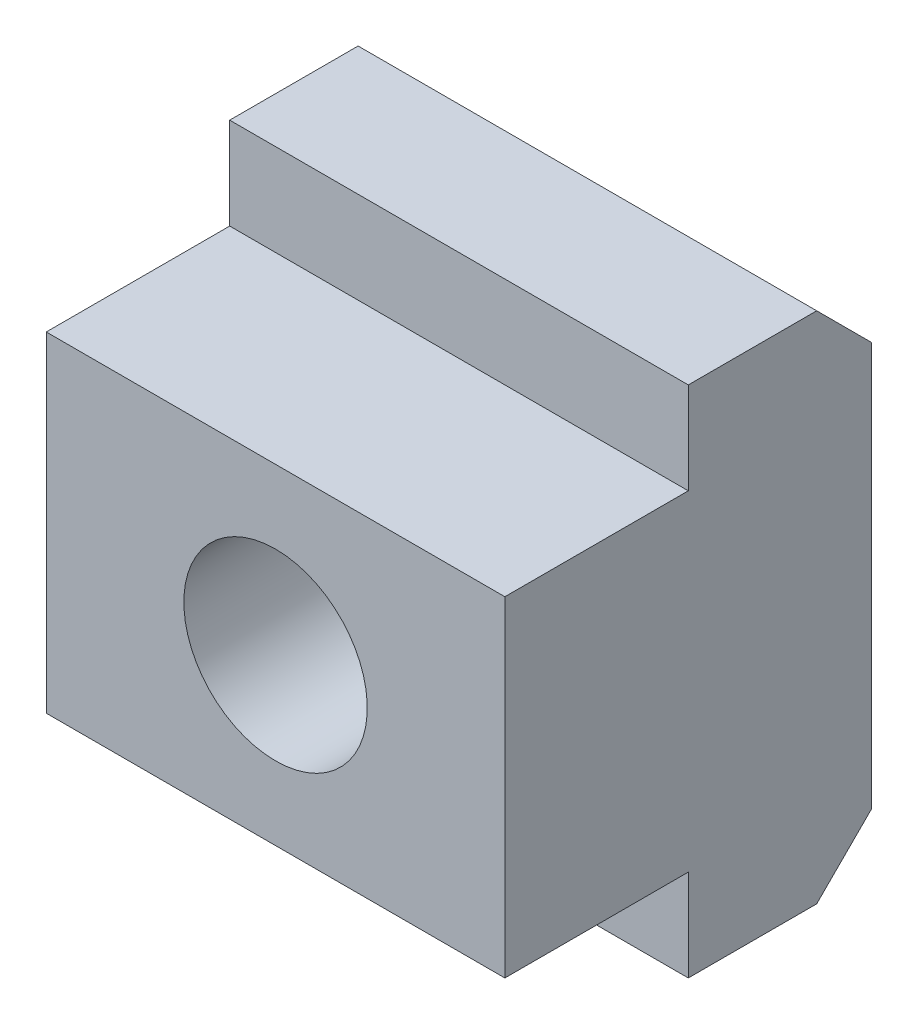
ISO-10303-21;
HEADER;
FILE_DESCRIPTION(('STEP AP214'),'2;1');
FILE_NAME('part.step','',(''),(''),'','','');
FILE_SCHEMA(('AUTOMOTIVE_DESIGN { 1 0 10303 214 1 1 1 1 }'));
ENDSEC;
DATA;
#1=APPLICATION_CONTEXT('core data for automotive mechanical design processes');
#2=APPLICATION_PROTOCOL_DEFINITION('international standard','automotive_design',2000,#1);
#3=PRODUCT_CONTEXT('',#1,'mechanical');
#4=PRODUCT('Part','Part','',(#3));
#5=PRODUCT_RELATED_PRODUCT_CATEGORY('part','',(#4));
#6=PRODUCT_DEFINITION_FORMATION('','',#4);
#7=PRODUCT_DEFINITION_CONTEXT('part definition',#1,'design');
#8=PRODUCT_DEFINITION('design','',#6,#7);
#9=PRODUCT_DEFINITION_SHAPE('','',#8);
#10=(LENGTH_UNIT() NAMED_UNIT(*) SI_UNIT(.MILLI.,.METRE.));
#11=(NAMED_UNIT(*) PLANE_ANGLE_UNIT() SI_UNIT($,.RADIAN.));
#12=(NAMED_UNIT(*) SI_UNIT($,.STERADIAN.) SOLID_ANGLE_UNIT());
#13=UNCERTAINTY_MEASURE_WITH_UNIT(LENGTH_MEASURE(1.E-05),#10,'distance_accuracy_value','');
#14=(GEOMETRIC_REPRESENTATION_CONTEXT(3) GLOBAL_UNCERTAINTY_ASSIGNED_CONTEXT((#13)) GLOBAL_UNIT_ASSIGNED_CONTEXT((#10,
#11,#12)) REPRESENTATION_CONTEXT('',''));
#15=CARTESIAN_POINT('',(0.,0.,0.));
#16=DIRECTION('',(0.,0.,1.));
#17=DIRECTION('',(1.,0.,0.));
#18=AXIS2_PLACEMENT_3D('',#15,#16,#17);
#19=CARTESIAN_POINT('',(-12.5,-9.,10.));
#20=DIRECTION('',(0.,1.,0.));
#21=DIRECTION('',(0.,0.,-1.));
#22=AXIS2_PLACEMENT_3D('',#19,#20,#21);
#23=PLANE('',#22);
#24=DIRECTION('',(0.,0.,1.));
#25=VECTOR('',#24,1.);
#26=CARTESIAN_POINT('',(12.5,-9.,10.));
#27=LINE('',#26,#25);
#28=CARTESIAN_POINT('',(12.5,-9.,0.));
#29=VERTEX_POINT('',#28);
#30=CARTESIAN_POINT('',(12.5,-9.,10.));
#31=VERTEX_POINT('',#30);
#32=EDGE_CURVE('E98',#29,#31,#27,.T.);
#33=ORIENTED_EDGE('',*,*,#32,.T.);
#34=DIRECTION('',(1.,0.,0.));
#35=VECTOR('',#34,1.);
#36=CARTESIAN_POINT('',(-12.5,-9.,10.));
#37=LINE('',#36,#35);
#38=CARTESIAN_POINT('',(-12.5,-9.,10.));
#39=VERTEX_POINT('',#38);
#40=EDGE_CURVE('E106',#39,#31,#37,.T.);
#41=ORIENTED_EDGE('',*,*,#40,.F.);
#42=DIRECTION('',(0.,0.,1.));
#43=VECTOR('',#42,1.);
#44=CARTESIAN_POINT('',(-12.5,-9.,10.));
#45=LINE('',#44,#43);
#46=CARTESIAN_POINT('',(-12.5,-9.,0.));
#47=VERTEX_POINT('',#46);
#48=EDGE_CURVE('E136',#47,#39,#45,.T.);
#49=ORIENTED_EDGE('',*,*,#48,.F.);
#50=DIRECTION('',(1.,0.,0.));
#51=VECTOR('',#50,1.);
#52=CARTESIAN_POINT('',(-12.5,-9.,0.));
#53=LINE('',#52,#51);
#54=EDGE_CURVE('E117',#47,#29,#53,.T.);
#55=ORIENTED_EDGE('',*,*,#54,.T.);
#56=EDGE_LOOP('',(#33,#41,#49,#55));
#57=FACE_BOUND('',#56,.T.);
#58=ADVANCED_FACE('F14',(#57),#23,.F.);
#59=CARTESIAN_POINT('',(-12.5,9.,10.));
#60=DIRECTION('',(0.,0.,-1.));
#61=DIRECTION('',(0.,-1.,0.));
#62=AXIS2_PLACEMENT_3D('',#59,#60,#61);
#63=PLANE('',#62);
#64=CARTESIAN_POINT('',(0.,0.,10.));
#65=DIRECTION('',(0.,0.,1.));
#66=DIRECTION('',(0.,1.,0.));
#67=AXIS2_PLACEMENT_3D('',#64,#65,#66);
#68=CIRCLE('',#67,5.);
#69=CARTESIAN_POINT('',(0.,5.00000000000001,10.));
#70=VERTEX_POINT('',#69);
#71=EDGE_CURVE('E121',#70,#70,#68,.T.);
#72=ORIENTED_EDGE('',*,*,#71,.F.);
#73=EDGE_LOOP('',(#72));
#74=FACE_BOUND('',#73,.T.);
#75=DIRECTION('',(0.,1.,0.));
#76=VECTOR('',#75,1.);
#77=CARTESIAN_POINT('',(12.5,9.,10.));
#78=LINE('',#77,#76);
#79=CARTESIAN_POINT('',(12.5,9.,10.));
#80=VERTEX_POINT('',#79);
#81=EDGE_CURVE('E92',#31,#80,#78,.T.);
#82=ORIENTED_EDGE('',*,*,#81,.T.);
#83=DIRECTION('',(1.,0.,0.));
#84=VECTOR('',#83,1.);
#85=CARTESIAN_POINT('',(-12.5,9.,10.));
#86=LINE('',#85,#84);
#87=CARTESIAN_POINT('',(-12.5,9.,10.));
#88=VERTEX_POINT('',#87);
#89=EDGE_CURVE('E113',#88,#80,#86,.T.);
#90=ORIENTED_EDGE('',*,*,#89,.F.);
#91=DIRECTION('',(0.,1.,0.));
#92=VECTOR('',#91,1.);
#93=CARTESIAN_POINT('',(-12.5,9.,10.));
#94=LINE('',#93,#92);
#95=EDGE_CURVE('E108',#39,#88,#94,.T.);
#96=ORIENTED_EDGE('',*,*,#95,.F.);
#97=ORIENTED_EDGE('',*,*,#40,.T.);
#98=EDGE_LOOP('',(#82,#90,#96,#97));
#99=FACE_BOUND('',#98,.T.);
#100=ADVANCED_FACE('F107',(#74,#99),#63,.F.);
#101=CARTESIAN_POINT('',(-12.5,9.,10.));
#102=DIRECTION('',(0.,-1.,0.));
#103=DIRECTION('',(1.,0.,0.));
#104=AXIS2_PLACEMENT_3D('',#101,#102,#103);
#105=PLANE('',#104);
#106=DIRECTION('',(0.,0.,-1.));
#107=VECTOR('',#106,1.);
#108=CARTESIAN_POINT('',(12.5,9.,10.));
#109=LINE('',#108,#107);
#110=CARTESIAN_POINT('',(12.5,9.,0.));
#111=VERTEX_POINT('',#110);
#112=EDGE_CURVE('E100',#80,#111,#109,.T.);
#113=ORIENTED_EDGE('',*,*,#112,.T.);
#114=DIRECTION('',(1.,0.,0.));
#115=VECTOR('',#114,1.);
#116=CARTESIAN_POINT('',(-12.5,9.,0.));
#117=LINE('',#116,#115);
#118=CARTESIAN_POINT('',(-12.5,9.,0.));
#119=VERTEX_POINT('',#118);
#120=EDGE_CURVE('E158',#119,#111,#117,.T.);
#121=ORIENTED_EDGE('',*,*,#120,.F.);
#122=DIRECTION('',(0.,0.,-1.));
#123=VECTOR('',#122,1.);
#124=CARTESIAN_POINT('',(-12.5,9.,10.));
#125=LINE('',#124,#123);
#126=EDGE_CURVE('E139',#88,#119,#125,.T.);
#127=ORIENTED_EDGE('',*,*,#126,.F.);
#128=ORIENTED_EDGE('',*,*,#89,.T.);
#129=EDGE_LOOP('',(#113,#121,#127,#128));
#130=FACE_BOUND('',#129,.T.);
#131=ADVANCED_FACE('F199',(#130),#105,.F.);
#132=CARTESIAN_POINT('',(-12.5,9.,0.));
#133=DIRECTION('',(0.,0.,-1.));
#134=DIRECTION('',(0.,-1.,0.));
#135=AXIS2_PLACEMENT_3D('',#132,#133,#134);
#136=PLANE('',#135);
#137=DIRECTION('',(0.,1.,0.));
#138=VECTOR('',#137,1.);
#139=CARTESIAN_POINT('',(12.5,9.,0.));
#140=LINE('',#139,#138);
#141=CARTESIAN_POINT('',(12.5,14.,0.));
#142=VERTEX_POINT('',#141);
#143=EDGE_CURVE('E126',#111,#142,#140,.T.);
#144=ORIENTED_EDGE('',*,*,#143,.T.);
#145=DIRECTION('',(1.,0.,0.));
#146=VECTOR('',#145,1.);
#147=CARTESIAN_POINT('',(-12.5,14.,0.));
#148=LINE('',#147,#146);
#149=CARTESIAN_POINT('',(-12.5,14.,0.));
#150=VERTEX_POINT('',#149);
#151=EDGE_CURVE('E155',#150,#142,#148,.T.);
#152=ORIENTED_EDGE('',*,*,#151,.F.);
#153=DIRECTION('',(0.,1.,0.));
#154=VECTOR('',#153,1.);
#155=CARTESIAN_POINT('',(-12.5,9.,0.));
#156=LINE('',#155,#154);
#157=EDGE_CURVE('E141',#119,#150,#156,.T.);
#158=ORIENTED_EDGE('',*,*,#157,.F.);
#159=ORIENTED_EDGE('',*,*,#120,.T.);
#160=EDGE_LOOP('',(#144,#152,#158,#159));
#161=FACE_BOUND('',#160,.T.);
#162=ADVANCED_FACE('F195',(#161),#136,.F.);
#163=CARTESIAN_POINT('',(-12.5,14.,0.));
#164=DIRECTION('',(0.,-1.,0.));
#165=DIRECTION('',(0.,0.,1.));
#166=AXIS2_PLACEMENT_3D('',#163,#164,#165);
#167=PLANE('',#166);
#168=DIRECTION('',(0.,0.,-1.));
#169=VECTOR('',#168,1.);
#170=CARTESIAN_POINT('',(12.5,14.,0.));
#171=LINE('',#170,#169);
#172=CARTESIAN_POINT('',(12.5,14.,-7.));
#173=VERTEX_POINT('',#172);
#174=EDGE_CURVE('E128',#142,#173,#171,.T.);
#175=ORIENTED_EDGE('',*,*,#174,.T.);
#176=DIRECTION('',(-1.,0.,0.));
#177=VECTOR('',#176,1.);
#178=CARTESIAN_POINT('',(-12.5,14.,-7.));
#179=LINE('',#178,#177);
#180=CARTESIAN_POINT('',(-12.5,14.,-7.));
#181=VERTEX_POINT('',#180);
#182=EDGE_CURVE('E9',#173,#181,#179,.T.);
#183=ORIENTED_EDGE('',*,*,#182,.T.);
#184=DIRECTION('',(0.,0.,-1.));
#185=VECTOR('',#184,1.);
#186=CARTESIAN_POINT('',(-12.5,14.,0.));
#187=LINE('',#186,#185);
#188=EDGE_CURVE('E143',#150,#181,#187,.T.);
#189=ORIENTED_EDGE('',*,*,#188,.F.);
#190=ORIENTED_EDGE('',*,*,#151,.T.);
#191=EDGE_LOOP('',(#175,#183,#189,#190));
#192=FACE_BOUND('',#191,.T.);
#193=ADVANCED_FACE('F191',(#192),#167,.F.);
#194=CARTESIAN_POINT('',(-12.5,14.,-10.));
#195=DIRECTION('',(0.,0.,1.));
#196=DIRECTION('',(0.,1.,0.));
#197=AXIS2_PLACEMENT_3D('',#194,#195,#196);
#198=PLANE('',#197);
#199=CARTESIAN_POINT('',(0.,0.,-10.));
#200=DIRECTION('',(0.,0.,1.));
#201=DIRECTION('',(0.,1.,0.));
#202=AXIS2_PLACEMENT_3D('',#199,#200,#201);
#203=CIRCLE('',#202,5.);
#204=CARTESIAN_POINT('',(0.,5.,-10.));
#205=VERTEX_POINT('',#204);
#206=EDGE_CURVE('E118',#205,#205,#203,.T.);
#207=ORIENTED_EDGE('',*,*,#206,.T.);
#208=EDGE_LOOP('',(#207));
#209=FACE_BOUND('',#208,.T.);
#210=DIRECTION('',(0.,-1.,0.));
#211=VECTOR('',#210,1.);
#212=CARTESIAN_POINT('',(12.5,14.,-10.));
#213=LINE('',#212,#211);
#214=CARTESIAN_POINT('',(12.5,11.,-10.));
#215=VERTEX_POINT('',#214);
#216=CARTESIAN_POINT('',(12.5,-11.,-10.));
#217=VERTEX_POINT('',#216);
#218=EDGE_CURVE('E130',#215,#217,#213,.T.);
#219=ORIENTED_EDGE('',*,*,#218,.T.);
#220=DIRECTION('',(-1.,0.,0.));
#221=VECTOR('',#220,1.);
#222=CARTESIAN_POINT('',(-12.5,-11.,-10.));
#223=LINE('',#222,#221);
#224=CARTESIAN_POINT('',(-12.5,-11.,-10.));
#225=VERTEX_POINT('',#224);
#226=EDGE_CURVE('E34',#217,#225,#223,.T.);
#227=ORIENTED_EDGE('',*,*,#226,.T.);
#228=DIRECTION('',(0.,-1.,0.));
#229=VECTOR('',#228,1.);
#230=CARTESIAN_POINT('',(-12.5,14.,-10.));
#231=LINE('',#230,#229);
#232=CARTESIAN_POINT('',(-12.5,11.,-10.));
#233=VERTEX_POINT('',#232);
#234=EDGE_CURVE('E145',#233,#225,#231,.T.);
#235=ORIENTED_EDGE('',*,*,#234,.F.);
#236=DIRECTION('',(1.,0.,0.));
#237=VECTOR('',#236,1.);
#238=CARTESIAN_POINT('',(-12.5,11.,-10.));
#239=LINE('',#238,#237);
#240=EDGE_CURVE('E168',#233,#215,#239,.T.);
#241=ORIENTED_EDGE('',*,*,#240,.T.);
#242=EDGE_LOOP('',(#219,#227,#235,#241));
#243=FACE_BOUND('',#242,.T.);
#244=ADVANCED_FACE('F185',(#209,#243),#198,.F.);
#245=CARTESIAN_POINT('',(-12.5,-14.,0.));
#246=DIRECTION('',(0.,1.,0.));
#247=DIRECTION('',(0.,0.,-1.));
#248=AXIS2_PLACEMENT_3D('',#245,#246,#247);
#249=PLANE('',#248);
#250=DIRECTION('',(0.,0.,1.));
#251=VECTOR('',#250,1.);
#252=CARTESIAN_POINT('',(-12.5,-14.,0.));
#253=LINE('',#252,#251);
#254=CARTESIAN_POINT('',(-12.5,-14.,-7.));
#255=VERTEX_POINT('',#254);
#256=CARTESIAN_POINT('',(-12.5,-14.,0.));
#257=VERTEX_POINT('',#256);
#258=EDGE_CURVE('E147',#255,#257,#253,.T.);
#259=ORIENTED_EDGE('',*,*,#258,.F.);
#260=DIRECTION('',(1.,0.,0.));
#261=VECTOR('',#260,1.);
#262=CARTESIAN_POINT('',(-12.5,-14.,-7.));
#263=LINE('',#262,#261);
#264=CARTESIAN_POINT('',(12.5,-14.,-7.));
#265=VERTEX_POINT('',#264);
#266=EDGE_CURVE('E112',#255,#265,#263,.T.);
#267=ORIENTED_EDGE('',*,*,#266,.T.);
#268=DIRECTION('',(0.,0.,1.));
#269=VECTOR('',#268,1.);
#270=CARTESIAN_POINT('',(12.5,-14.,0.));
#271=LINE('',#270,#269);
#272=CARTESIAN_POINT('',(12.5,-14.,0.));
#273=VERTEX_POINT('',#272);
#274=EDGE_CURVE('E132',#265,#273,#271,.T.);
#275=ORIENTED_EDGE('',*,*,#274,.T.);
#276=DIRECTION('',(1.,0.,0.));
#277=VECTOR('',#276,1.);
#278=CARTESIAN_POINT('',(-12.5,-14.,0.));
#279=LINE('',#278,#277);
#280=EDGE_CURVE('E152',#257,#273,#279,.T.);
#281=ORIENTED_EDGE('',*,*,#280,.F.);
#282=EDGE_LOOP('',(#259,#267,#275,#281));
#283=FACE_BOUND('',#282,.T.);
#284=ADVANCED_FACE('F181',(#283),#249,.F.);
#285=CARTESIAN_POINT('',(-12.5,-9.,0.));
#286=DIRECTION('',(0.,0.,-1.));
#287=DIRECTION('',(0.,-1.,0.));
#288=AXIS2_PLACEMENT_3D('',#285,#286,#287);
#289=PLANE('',#288);
#290=DIRECTION('',(0.,1.,0.));
#291=VECTOR('',#290,1.);
#292=CARTESIAN_POINT('',(12.5,-9.,0.));
#293=LINE('',#292,#291);
#294=EDGE_CURVE('E134',#273,#29,#293,.T.);
#295=ORIENTED_EDGE('',*,*,#294,.T.);
#296=ORIENTED_EDGE('',*,*,#54,.F.);
#297=DIRECTION('',(0.,1.,0.));
#298=VECTOR('',#297,1.);
#299=CARTESIAN_POINT('',(-12.5,-9.,0.));
#300=LINE('',#299,#298);
#301=EDGE_CURVE('E149',#257,#47,#300,.T.);
#302=ORIENTED_EDGE('',*,*,#301,.F.);
#303=ORIENTED_EDGE('',*,*,#280,.T.);
#304=EDGE_LOOP('',(#295,#296,#302,#303));
#305=FACE_BOUND('',#304,.T.);
#306=ADVANCED_FACE('F201',(#305),#289,.F.);
#307=CARTESIAN_POINT('',(-12.5,-9.,10.));
#308=DIRECTION('',(-1.,0.,0.));
#309=DIRECTION('',(0.,-1.,0.));
#310=AXIS2_PLACEMENT_3D('',#307,#308,#309);
#311=PLANE('',#310);
#312=ORIENTED_EDGE('',*,*,#234,.T.);
#313=DIRECTION('',(0.,0.707106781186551,-0.707106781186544));
#314=VECTOR('',#313,1.);
#315=CARTESIAN_POINT('',(-12.5,-20.,-1.));
#316=LINE('',#315,#314);
#317=EDGE_CURVE('E21',#225,#255,#316,.F.);
#318=ORIENTED_EDGE('',*,*,#317,.T.);
#319=ORIENTED_EDGE('',*,*,#258,.T.);
#320=ORIENTED_EDGE('',*,*,#301,.T.);
#321=ORIENTED_EDGE('',*,*,#48,.T.);
#322=ORIENTED_EDGE('',*,*,#95,.T.);
#323=ORIENTED_EDGE('',*,*,#126,.T.);
#324=ORIENTED_EDGE('',*,*,#157,.T.);
#325=ORIENTED_EDGE('',*,*,#188,.T.);
#326=DIRECTION('',(0.,0.707106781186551,0.707106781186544));
#327=VECTOR('',#326,1.);
#328=CARTESIAN_POINT('',(-12.5,10.9999999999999,-10.));
#329=LINE('',#328,#327);
#330=EDGE_CURVE('E172',#181,#233,#329,.F.);
#331=ORIENTED_EDGE('',*,*,#330,.T.);
#332=EDGE_LOOP('',(#312,#318,#319,#320,#321,#322,#323,#324,#325,#331));
#333=FACE_BOUND('',#332,.T.);
#334=ADVANCED_FACE('F176',(#333),#311,.T.);
#335=CARTESIAN_POINT('',(12.5,-9.,10.));
#336=DIRECTION('',(-1.,0.,0.));
#337=DIRECTION('',(0.,-1.,0.));
#338=AXIS2_PLACEMENT_3D('',#335,#336,#337);
#339=PLANE('',#338);
#340=ORIENTED_EDGE('',*,*,#274,.F.);
#341=DIRECTION('',(0.,-0.707106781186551,0.707106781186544));
#342=VECTOR('',#341,1.);
#343=CARTESIAN_POINT('',(12.5,-14.,-7.));
#344=LINE('',#343,#342);
#345=EDGE_CURVE('E166',#265,#217,#344,.F.);
#346=ORIENTED_EDGE('',*,*,#345,.T.);
#347=ORIENTED_EDGE('',*,*,#218,.F.);
#348=DIRECTION('',(0.,-0.707106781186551,-0.707106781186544));
#349=VECTOR('',#348,1.);
#350=CARTESIAN_POINT('',(12.5,11.,-10.));
#351=LINE('',#350,#349);
#352=EDGE_CURVE('E164',#215,#173,#351,.F.);
#353=ORIENTED_EDGE('',*,*,#352,.T.);
#354=ORIENTED_EDGE('',*,*,#174,.F.);
#355=ORIENTED_EDGE('',*,*,#143,.F.);
#356=ORIENTED_EDGE('',*,*,#112,.F.);
#357=ORIENTED_EDGE('',*,*,#81,.F.);
#358=ORIENTED_EDGE('',*,*,#32,.F.);
#359=ORIENTED_EDGE('',*,*,#294,.F.);
#360=EDGE_LOOP('',(#340,#346,#347,#353,#354,#355,#356,#357,#358,#359));
#361=FACE_BOUND('',#360,.T.);
#362=ADVANCED_FACE('F95',(#361),#339,.F.);
#363=CARTESIAN_POINT('',(-12.5,-14.,-7.));
#364=DIRECTION('',(0.,0.707106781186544,0.707106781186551));
#365=DIRECTION('',(0.,0.707106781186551,-0.707106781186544));
#366=AXIS2_PLACEMENT_3D('',#363,#364,#365);
#367=PLANE('',#366);
#368=ORIENTED_EDGE('',*,*,#317,.F.);
#369=ORIENTED_EDGE('',*,*,#226,.F.);
#370=ORIENTED_EDGE('',*,*,#345,.F.);
#371=ORIENTED_EDGE('',*,*,#266,.F.);
#372=EDGE_LOOP('',(#368,#369,#370,#371));
#373=FACE_BOUND('',#372,.T.);
#374=ADVANCED_FACE('F183',(#373),#367,.F.);
#375=CARTESIAN_POINT('',(-12.5,11.,-10.));
#376=DIRECTION('',(0.,-0.707106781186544,0.707106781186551));
#377=DIRECTION('',(0.,0.707106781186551,0.707106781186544));
#378=AXIS2_PLACEMENT_3D('',#375,#376,#377);
#379=PLANE('',#378);
#380=ORIENTED_EDGE('',*,*,#330,.F.);
#381=ORIENTED_EDGE('',*,*,#182,.F.);
#382=ORIENTED_EDGE('',*,*,#352,.F.);
#383=ORIENTED_EDGE('',*,*,#240,.F.);
#384=EDGE_LOOP('',(#380,#381,#382,#383));
#385=FACE_BOUND('',#384,.T.);
#386=ADVANCED_FACE('F189',(#385),#379,.F.);
#387=CARTESIAN_POINT('',(0.,0.,-10.));
#388=DIRECTION('',(0.,0.,1.));
#389=DIRECTION('',(0.,1.,0.));
#390=AXIS2_PLACEMENT_3D('',#387,#388,#389);
#391=CYLINDRICAL_SURFACE('',#390,5.);
#392=ORIENTED_EDGE('',*,*,#206,.F.);
#393=EDGE_LOOP('',(#392));
#394=FACE_BOUND('',#393,.T.);
#395=ORIENTED_EDGE('',*,*,#71,.T.);
#396=EDGE_LOOP('',(#395));
#397=FACE_BOUND('',#396,.T.);
#398=ADVANCED_FACE('F236',(#394,#397),#391,.F.);
#399=CLOSED_SHELL('',(#58,#100,#131,#162,#193,#244,#284,#306,#334,#362,#374,#386,#398));
#400=MANIFOLD_SOLID_BREP('B1',#399);
#401=ADVANCED_BREP_SHAPE_REPRESENTATION('',(#18,#400),#14);
#402=SHAPE_DEFINITION_REPRESENTATION(#9,#401);
ENDSEC;
END-ISO-10303-21;
